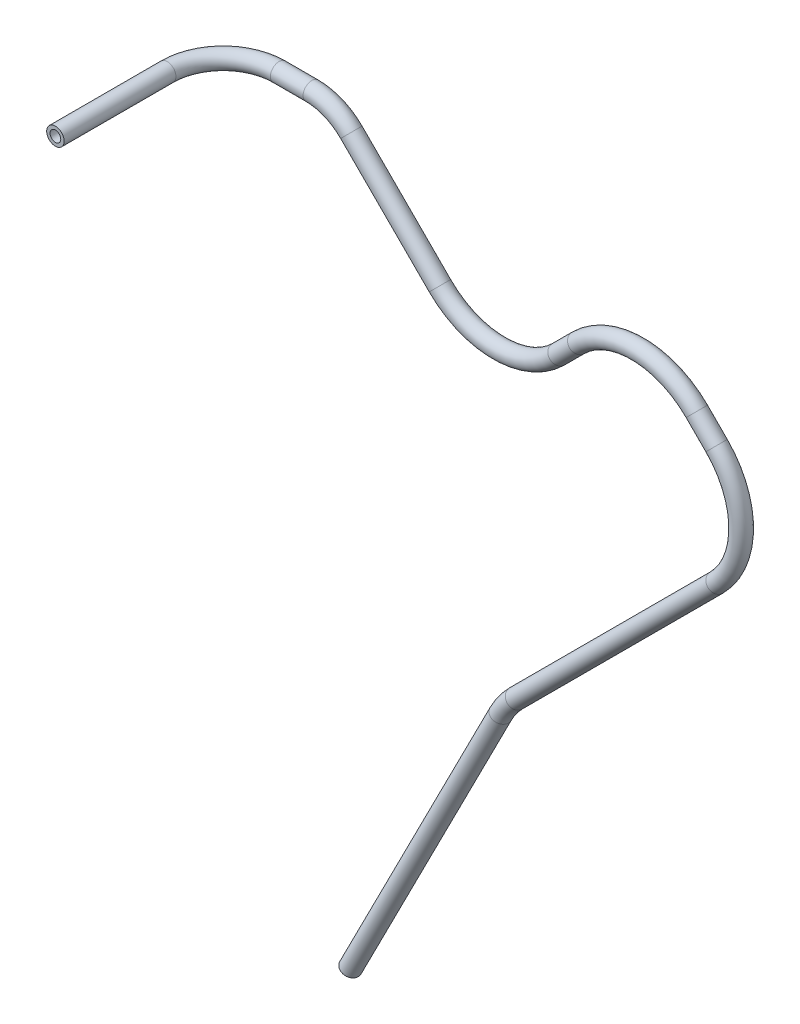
ISO-10303-21;
HEADER;
FILE_DESCRIPTION(('STEP AP214'),'2;1');
FILE_NAME('part.step','',(''),(''),'','','');
FILE_SCHEMA(('AUTOMOTIVE_DESIGN { 1 0 10303 214 1 1 1 1 }'));
ENDSEC;
DATA;
#1=APPLICATION_CONTEXT('core data for automotive mechanical design processes');
#2=APPLICATION_PROTOCOL_DEFINITION('international standard','automotive_design',2000,#1);
#3=PRODUCT_CONTEXT('',#1,'mechanical');
#4=PRODUCT('Part','Part','',(#3));
#5=PRODUCT_RELATED_PRODUCT_CATEGORY('part','',(#4));
#6=PRODUCT_DEFINITION_FORMATION('','',#4);
#7=PRODUCT_DEFINITION_CONTEXT('part definition',#1,'design');
#8=PRODUCT_DEFINITION('design','',#6,#7);
#9=PRODUCT_DEFINITION_SHAPE('','',#8);
#10=(LENGTH_UNIT() NAMED_UNIT(*) SI_UNIT(.MILLI.,.METRE.));
#11=(NAMED_UNIT(*) PLANE_ANGLE_UNIT() SI_UNIT($,.RADIAN.));
#12=(NAMED_UNIT(*) SI_UNIT($,.STERADIAN.) SOLID_ANGLE_UNIT());
#13=UNCERTAINTY_MEASURE_WITH_UNIT(LENGTH_MEASURE(1.E-05),#10,'distance_accuracy_value','');
#14=(GEOMETRIC_REPRESENTATION_CONTEXT(3) GLOBAL_UNCERTAINTY_ASSIGNED_CONTEXT((#13)) GLOBAL_UNIT_ASSIGNED_CONTEXT((#10,
#11,#12)) REPRESENTATION_CONTEXT('',''));
#15=CARTESIAN_POINT('',(0.,0.,0.));
#16=DIRECTION('',(0.,0.,1.));
#17=DIRECTION('',(1.,0.,0.));
#18=AXIS2_PLACEMENT_3D('',#15,#16,#17);
#19=CARTESIAN_POINT('',(0.,0.,0.));
#20=DIRECTION('',(0.,0.,-1.));
#21=DIRECTION('',(-1.,0.,0.));
#22=AXIS2_PLACEMENT_3D('',#19,#20,#21);
#23=CYLINDRICAL_SURFACE('',#22,7.9375);
#24=CARTESIAN_POINT('',(0.,0.,-101.6));
#25=DIRECTION('',(0.,0.,1.));
#26=DIRECTION('',(1.,0.,0.));
#27=AXIS2_PLACEMENT_3D('',#24,#25,#26);
#28=CIRCLE('',#27,7.9375);
#29=CARTESIAN_POINT('',(-7.9375,0.,-101.6));
#30=VERTEX_POINT('',#29);
#31=EDGE_CURVE('E171',#30,#30,#28,.T.);
#32=ORIENTED_EDGE('',*,*,#31,.T.);
#33=EDGE_LOOP('',(#32));
#34=FACE_BOUND('',#33,.T.);
#35=CARTESIAN_POINT('',(0.,0.,0.));
#36=DIRECTION('',(0.,0.,1.));
#37=DIRECTION('',(1.,0.,0.));
#38=AXIS2_PLACEMENT_3D('',#35,#36,#37);
#39=CIRCLE('',#38,7.9375);
#40=CARTESIAN_POINT('',(7.9375,0.,0.));
#41=VERTEX_POINT('',#40);
#42=EDGE_CURVE('E49',#41,#41,#39,.T.);
#43=ORIENTED_EDGE('',*,*,#42,.F.);
#44=EDGE_LOOP('',(#43));
#45=FACE_BOUND('',#44,.T.);
#46=ADVANCED_FACE('F34',(#34,#45),#23,.T.);
#47=CARTESIAN_POINT('',(50.8,0.,-101.6));
#48=DIRECTION('',(0.,-1.,0.));
#49=DIRECTION('',(0.,0.,-1.));
#50=AXIS2_PLACEMENT_3D('',#47,#48,#49);
#51=TOROIDAL_SURFACE('',#50,50.8,7.9375);
#52=CARTESIAN_POINT('',(50.8,0.,-152.4));
#53=DIRECTION('',(-1.,0.,0.));
#54=DIRECTION('',(0.,0.,1.));
#55=AXIS2_PLACEMENT_3D('',#52,#53,#54);
#56=CIRCLE('',#55,7.9375);
#57=CARTESIAN_POINT('',(50.8,0.,-160.3375));
#58=VERTEX_POINT('',#57);
#59=EDGE_CURVE('E174',#58,#58,#56,.T.);
#60=CARTESIAN_POINT('',(50.8,0.,-101.6));
#61=DIRECTION('',(0.,-1.,0.));
#62=DIRECTION('',(0.,0.,-1.));
#63=AXIS2_PLACEMENT_3D('',#60,#61,#62);
#64=CIRCLE('',#63,58.7375);
#65=EDGE_CURVE('',#30,#58,#64,.T.);
#66=ORIENTED_EDGE('',*,*,#31,.F.);
#67=ORIENTED_EDGE('',*,*,#59,.T.);
#68=ORIENTED_EDGE('',*,*,#65,.T.);
#69=ORIENTED_EDGE('',*,*,#65,.F.);
#70=EDGE_LOOP('',(#66,#68,#67,#69));
#71=FACE_BOUND('',#70,.T.);
#72=ADVANCED_FACE('F252',(#71),#51,.T.);
#73=CARTESIAN_POINT('',(50.8,0.,-152.4));
#74=DIRECTION('',(1.,0.,0.));
#75=DIRECTION('',(0.,0.,-1.));
#76=AXIS2_PLACEMENT_3D('',#73,#74,#75);
#77=CYLINDRICAL_SURFACE('',#76,7.9375);
#78=CARTESIAN_POINT('',(80.5579510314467,0.,-152.4));
#79=DIRECTION('',(-1.,0.,0.));
#80=DIRECTION('',(0.,0.,1.));
#81=AXIS2_PLACEMENT_3D('',#78,#79,#80);
#82=CIRCLE('',#81,7.9375);
#83=CARTESIAN_POINT('',(80.5579510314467,7.9375,-152.399999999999));
#84=VERTEX_POINT('',#83);
#85=EDGE_CURVE('E177',#84,#84,#82,.T.);
#86=ORIENTED_EDGE('',*,*,#85,.T.);
#87=EDGE_LOOP('',(#86));
#88=FACE_BOUND('',#87,.T.);
#89=ORIENTED_EDGE('',*,*,#59,.F.);
#90=EDGE_LOOP('',(#89));
#91=FACE_BOUND('',#90,.T.);
#92=ADVANCED_FACE('F248',(#88,#91),#77,.T.);
#93=CARTESIAN_POINT('',(80.5579510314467,-50.8,-152.400000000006));
#94=DIRECTION('',(0.,0.,-1.));
#95=DIRECTION('',(0.,1.,0.));
#96=AXIS2_PLACEMENT_3D('',#93,#94,#95);
#97=TOROIDAL_SURFACE('',#96,50.8,7.9375);
#98=CARTESIAN_POINT('',(116.478975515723,-14.8789755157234,-152.400000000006));
#99=DIRECTION('',(-0.707106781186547,0.707106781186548,0.));
#100=DIRECTION('',(0.,0.,1.));
#101=AXIS2_PLACEMENT_3D('',#98,#99,#100);
#102=CIRCLE('',#101,7.9375);
#103=CARTESIAN_POINT('',(122.091635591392,-9.26631544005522,-152.400000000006));
#104=VERTEX_POINT('',#103);
#105=EDGE_CURVE('E180',#104,#104,#102,.T.);
#106=CARTESIAN_POINT('',(80.5579510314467,-50.8,-152.400000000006));
#107=DIRECTION('',(0.,0.,-1.));
#108=DIRECTION('',(0.,1.,0.));
#109=AXIS2_PLACEMENT_3D('',#106,#107,#108);
#110=CIRCLE('',#109,58.7375);
#111=EDGE_CURVE('',#84,#104,#110,.T.);
#112=ORIENTED_EDGE('',*,*,#85,.F.);
#113=ORIENTED_EDGE('',*,*,#105,.T.);
#114=ORIENTED_EDGE('',*,*,#111,.T.);
#115=ORIENTED_EDGE('',*,*,#111,.F.);
#116=EDGE_LOOP('',(#112,#114,#113,#115));
#117=FACE_BOUND('',#116,.T.);
#118=ADVANCED_FACE('F244',(#117),#97,.T.);
#119=CARTESIAN_POINT('',(116.478975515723,-14.8789755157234,-152.400000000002));
#120=DIRECTION('',(0.707106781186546,-0.707106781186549,0.));
#121=DIRECTION('',(0.707106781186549,0.707106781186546,0.));
#122=AXIS2_PLACEMENT_3D('',#119,#120,#121);
#123=CYLINDRICAL_SURFACE('',#122,7.9375);
#124=CARTESIAN_POINT('',(196.965593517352,-95.3655935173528,-152.399999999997));
#125=DIRECTION('',(-0.707106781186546,0.707106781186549,0.));
#126=DIRECTION('',(0.,0.,1.));
#127=AXIS2_PLACEMENT_3D('',#124,#125,#126);
#128=CIRCLE('',#127,7.9375);
#129=CARTESIAN_POINT('',(191.352933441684,-100.978253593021,-152.399999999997));
#130=VERTEX_POINT('',#129);
#131=EDGE_CURVE('E183',#130,#130,#128,.T.);
#132=ORIENTED_EDGE('',*,*,#131,.T.);
#133=EDGE_LOOP('',(#132));
#134=FACE_BOUND('',#133,.T.);
#135=ORIENTED_EDGE('',*,*,#105,.F.);
#136=EDGE_LOOP('',(#135));
#137=FACE_BOUND('',#136,.T.);
#138=ADVANCED_FACE('F240',(#134,#137),#123,.T.);
#139=CARTESIAN_POINT('',(250.847130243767,-41.4840567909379,-152.399999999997));
#140=DIRECTION('',(0.,0.,1.));
#141=DIRECTION('',(1.,0.,0.));
#142=AXIS2_PLACEMENT_3D('',#139,#140,#141);
#143=TOROIDAL_SURFACE('',#142,76.2,7.9375);
#144=CARTESIAN_POINT('',(304.728666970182,-95.3655935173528,-152.399999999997));
#145=DIRECTION('',(-0.707106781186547,-0.707106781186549,0.));
#146=DIRECTION('',(0.,0.,1.));
#147=AXIS2_PLACEMENT_3D('',#144,#145,#146);
#148=CIRCLE('',#147,7.9375);
#149=CARTESIAN_POINT('',(310.341327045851,-100.978253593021,-152.399999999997));
#150=VERTEX_POINT('',#149);
#151=EDGE_CURVE('E186',#150,#150,#148,.T.);
#152=CARTESIAN_POINT('',(250.847130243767,-41.4840567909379,-152.399999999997));
#153=DIRECTION('',(0.,0.,1.));
#154=DIRECTION('',(1.,0.,0.));
#155=AXIS2_PLACEMENT_3D('',#152,#153,#154);
#156=CIRCLE('',#155,84.1375);
#157=EDGE_CURVE('',#130,#150,#156,.T.);
#158=ORIENTED_EDGE('',*,*,#131,.F.);
#159=ORIENTED_EDGE('',*,*,#151,.T.);
#160=ORIENTED_EDGE('',*,*,#157,.T.);
#161=ORIENTED_EDGE('',*,*,#157,.F.);
#162=EDGE_LOOP('',(#158,#160,#159,#161));
#163=FACE_BOUND('',#162,.T.);
#164=ADVANCED_FACE('F236',(#163),#143,.T.);
#165=CARTESIAN_POINT('',(304.728666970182,-95.3655935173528,-152.399999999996));
#166=DIRECTION('',(0.707106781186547,0.707106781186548,0.));
#167=DIRECTION('',(-0.707106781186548,0.707106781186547,0.));
#168=AXIS2_PLACEMENT_3D('',#165,#166,#167);
#169=CYLINDRICAL_SURFACE('',#168,7.9375);
#170=CARTESIAN_POINT('',(322.574619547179,-77.5196409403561,-152.399999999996));
#171=DIRECTION('',(-0.707106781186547,-0.707106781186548,0.));
#172=DIRECTION('',(0.,0.,1.));
#173=AXIS2_PLACEMENT_3D('',#170,#171,#172);
#174=CIRCLE('',#173,7.9375);
#175=CARTESIAN_POINT('',(316.961959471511,-71.9069808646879,-152.399999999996));
#176=VERTEX_POINT('',#175);
#177=EDGE_CURVE('E189',#176,#176,#174,.T.);
#178=ORIENTED_EDGE('',*,*,#177,.T.);
#179=EDGE_LOOP('',(#178));
#180=FACE_BOUND('',#179,.T.);
#181=ORIENTED_EDGE('',*,*,#151,.F.);
#182=EDGE_LOOP('',(#181));
#183=FACE_BOUND('',#182,.T.);
#184=ADVANCED_FACE('F232',(#180,#183),#169,.T.);
#185=CARTESIAN_POINT('',(376.456156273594,-131.401177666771,-152.399999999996));
#186=DIRECTION('',(0.,0.,-1.));
#187=DIRECTION('',(-1.,0.,0.));
#188=AXIS2_PLACEMENT_3D('',#185,#186,#187);
#189=TOROIDAL_SURFACE('',#188,76.2,7.9375);
#190=CARTESIAN_POINT('',(430.337693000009,-77.519640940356,-152.399999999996));
#191=DIRECTION('',(-0.707106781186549,0.707106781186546,0.));
#192=DIRECTION('',(0.,0.,1.));
#193=AXIS2_PLACEMENT_3D('',#190,#191,#192);
#194=CIRCLE('',#193,7.9375);
#195=CARTESIAN_POINT('',(435.950353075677,-71.9069808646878,-152.399999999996));
#196=VERTEX_POINT('',#195);
#197=EDGE_CURVE('E192',#196,#196,#194,.T.);
#198=CARTESIAN_POINT('',(376.456156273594,-131.401177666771,-152.399999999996));
#199=DIRECTION('',(0.,0.,-1.));
#200=DIRECTION('',(-1.,0.,0.));
#201=AXIS2_PLACEMENT_3D('',#198,#199,#200);
#202=CIRCLE('',#201,84.1375);
#203=EDGE_CURVE('',#176,#196,#202,.T.);
#204=ORIENTED_EDGE('',*,*,#177,.F.);
#205=ORIENTED_EDGE('',*,*,#197,.T.);
#206=ORIENTED_EDGE('',*,*,#203,.T.);
#207=ORIENTED_EDGE('',*,*,#203,.F.);
#208=EDGE_LOOP('',(#204,#206,#205,#207));
#209=FACE_BOUND('',#208,.T.);
#210=ADVANCED_FACE('F228',(#209),#189,.T.);
#211=CARTESIAN_POINT('',(430.337693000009,-77.519640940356,-152.399999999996));
#212=DIRECTION('',(0.707106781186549,-0.707106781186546,0.));
#213=DIRECTION('',(0.707106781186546,0.707106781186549,0.));
#214=AXIS2_PLACEMENT_3D('',#211,#212,#213);
#215=CYLINDRICAL_SURFACE('',#214,7.9375);
#216=CARTESIAN_POINT('',(448.298205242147,-95.4801531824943,-152.399999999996));
#217=DIRECTION('',(-0.707106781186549,0.707106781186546,0.));
#218=DIRECTION('',(0.,0.,1.));
#219=AXIS2_PLACEMENT_3D('',#216,#217,#218);
#220=CIRCLE('',#219,7.9375);
#221=CARTESIAN_POINT('',(453.910865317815,-89.8674931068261,-152.399999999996));
#222=VERTEX_POINT('',#221);
#223=EDGE_CURVE('E195',#222,#222,#220,.T.);
#224=CARTESIAN_POINT('',(453.910865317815,-89.8674931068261,-152.399999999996));
#225=CARTESIAN_POINT('',(453.723776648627,-89.6804044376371,-152.399999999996));
#226=CARTESIAN_POINT('',(453.536687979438,-89.4933157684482,-152.399999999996));
#227=CARTESIAN_POINT('',(453.16251064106,-89.1191384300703,-152.399999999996));
#228=CARTESIAN_POINT('',(452.975421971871,-88.9320497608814,-152.399999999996));
#229=CARTESIAN_POINT('',(452.601244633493,-88.5578724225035,-152.399999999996));
#230=CARTESIAN_POINT('',(452.414155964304,-88.3707837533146,-152.399999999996));
#231=CARTESIAN_POINT('',(452.039978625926,-87.9966064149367,-152.399999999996));
#232=CARTESIAN_POINT('',(451.852889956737,-87.8095177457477,-152.399999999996));
#233=CARTESIAN_POINT('',(451.478712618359,-87.4353404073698,-152.399999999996));
#234=CARTESIAN_POINT('',(451.29162394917,-87.2482517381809,-152.399999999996));
#235=CARTESIAN_POINT('',(450.917446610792,-86.874074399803,-152.399999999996));
#236=CARTESIAN_POINT('',(450.730357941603,-86.6869857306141,-152.399999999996));
#237=CARTESIAN_POINT('',(450.356180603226,-86.3128083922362,-152.399999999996));
#238=CARTESIAN_POINT('',(450.169091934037,-86.1257197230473,-152.399999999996));
#239=CARTESIAN_POINT('',(449.794914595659,-85.7515423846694,-152.399999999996));
#240=CARTESIAN_POINT('',(449.60782592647,-85.5644537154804,-152.399999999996));
#241=CARTESIAN_POINT('',(449.233648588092,-85.1902763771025,-152.399999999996));
#242=CARTESIAN_POINT('',(449.046559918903,-85.0031877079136,-152.399999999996));
#243=CARTESIAN_POINT('',(448.672382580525,-84.6290103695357,-152.399999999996));
#244=CARTESIAN_POINT('',(448.485293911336,-84.4419217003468,-152.399999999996));
#245=CARTESIAN_POINT('',(448.111116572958,-84.0677443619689,-152.399999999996));
#246=CARTESIAN_POINT('',(447.924027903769,-83.88065569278,-152.399999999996));
#247=CARTESIAN_POINT('',(447.549850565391,-83.5064783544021,-152.399999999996));
#248=CARTESIAN_POINT('',(447.362761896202,-83.3193896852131,-152.399999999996));
#249=CARTESIAN_POINT('',(446.988584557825,-82.9452123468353,-152.399999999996));
#250=CARTESIAN_POINT('',(446.801495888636,-82.7581236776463,-152.399999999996));
#251=CARTESIAN_POINT('',(446.427318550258,-82.3839463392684,-152.399999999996));
#252=CARTESIAN_POINT('',(446.240229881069,-82.1968576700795,-152.399999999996));
#253=CARTESIAN_POINT('',(445.866052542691,-81.8226803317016,-152.399999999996));
#254=CARTESIAN_POINT('',(445.678963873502,-81.6355916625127,-152.399999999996));
#255=CARTESIAN_POINT('',(445.304786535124,-81.2614143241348,-152.399999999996));
#256=CARTESIAN_POINT('',(445.117697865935,-81.0743256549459,-152.399999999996));
#257=CARTESIAN_POINT('',(444.743520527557,-80.700148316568,-152.399999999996));
#258=CARTESIAN_POINT('',(444.556431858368,-80.513059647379,-152.399999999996));
#259=CARTESIAN_POINT('',(444.18225451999,-80.1388823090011,-152.399999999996));
#260=CARTESIAN_POINT('',(443.995165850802,-79.9517936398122,-152.399999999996));
#261=CARTESIAN_POINT('',(443.620988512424,-79.5776163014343,-152.399999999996));
#262=CARTESIAN_POINT('',(443.433899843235,-79.3905276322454,-152.399999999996));
#263=CARTESIAN_POINT('',(443.059722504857,-79.0163502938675,-152.399999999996));
#264=CARTESIAN_POINT('',(442.872633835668,-78.8292616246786,-152.399999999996));
#265=CARTESIAN_POINT('',(442.49845649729,-78.4550842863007,-152.399999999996));
#266=CARTESIAN_POINT('',(442.311367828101,-78.2679956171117,-152.399999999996));
#267=CARTESIAN_POINT('',(441.937190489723,-77.8938182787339,-152.399999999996));
#268=CARTESIAN_POINT('',(441.750101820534,-77.7067296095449,-152.399999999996));
#269=CARTESIAN_POINT('',(441.375924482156,-77.332552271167,-152.399999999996));
#270=CARTESIAN_POINT('',(441.188835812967,-77.1454636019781,-152.399999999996));
#271=CARTESIAN_POINT('',(440.81465847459,-76.7712862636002,-152.399999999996));
#272=CARTESIAN_POINT('',(440.627569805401,-76.5841975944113,-152.399999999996));
#273=CARTESIAN_POINT('',(440.253392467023,-76.2100202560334,-152.399999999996));
#274=CARTESIAN_POINT('',(440.066303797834,-76.0229315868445,-152.399999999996));
#275=CARTESIAN_POINT('',(439.692126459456,-75.6487542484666,-152.399999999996));
#276=CARTESIAN_POINT('',(439.505037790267,-75.4616655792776,-152.399999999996));
#277=CARTESIAN_POINT('',(439.130860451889,-75.0874882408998,-152.399999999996));
#278=CARTESIAN_POINT('',(438.9437717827,-74.9003995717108,-152.399999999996));
#279=CARTESIAN_POINT('',(438.569594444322,-74.5262222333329,-152.399999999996));
#280=CARTESIAN_POINT('',(438.382505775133,-74.339133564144,-152.399999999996));
#281=CARTESIAN_POINT('',(438.008328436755,-73.9649562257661,-152.399999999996));
#282=CARTESIAN_POINT('',(437.821239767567,-73.7778675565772,-152.399999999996));
#283=CARTESIAN_POINT('',(437.447062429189,-73.4036902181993,-152.399999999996));
#284=CARTESIAN_POINT('',(437.25997376,-73.2166015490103,-152.399999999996));
#285=CARTESIAN_POINT('',(436.885796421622,-72.8424242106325,-152.399999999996));
#286=CARTESIAN_POINT('',(436.698707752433,-72.6553355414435,-152.399999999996));
#287=CARTESIAN_POINT('',(436.324530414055,-72.2811582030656,-152.399999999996));
#288=CARTESIAN_POINT('',(436.137441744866,-72.0940695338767,-152.399999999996));
#289=CARTESIAN_POINT('',(435.950353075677,-71.9069808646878,-152.399999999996));
#290=B_SPLINE_CURVE_WITH_KNOTS('',3,(#224,#225,#226,#227,#228,#229,#230,#231,#232,#233,#234,
#235,#236,#237,#238,#239,#240,#241,#242,#243,#244,#245,#246,#247,#248,#249,#250,#251,#252,#253,
#254,#255,#256,#257,#258,#259,#260,#261,#262,#263,#264,#265,#266,#267,#268,#269,#270,#271,#272,
#273,#274,#275,#276,#277,#278,#279,#280,#281,#282,#283,#284,#285,#286,#287,#288,#289),
.UNSPECIFIED.,.F.,.F.,(4,2,2,2,2,2,2,2,2,2,2,2,2,2,2,2,2,2,2,2,2,2,2,2,2,2,2,2,2,2,2,2,4),(0.,
0.793750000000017,1.58750000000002,2.38125000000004,3.17500000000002,3.96875000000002,
4.76250000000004,5.55625000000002,6.35000000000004,7.14375000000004,7.93750000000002,
8.73125000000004,9.52500000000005,10.3187500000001,11.1125,11.9062500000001,12.7000000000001,
13.4937500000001,14.2875000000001,15.0812500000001,15.8750000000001,16.6687500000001,
17.4625000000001,18.2562500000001,19.0500000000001,19.8437500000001,20.6375000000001,
21.4312500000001,22.2250000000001,23.0187500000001,23.8125000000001,24.6062500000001,
25.4000000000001),.UNSPECIFIED.);
#291=EDGE_CURVE('BSEAM224',#222,#196,#290,.T.);
#292=ORIENTED_EDGE('',*,*,#223,.T.);
#293=ORIENTED_EDGE('',*,*,#197,.F.);
#294=ORIENTED_EDGE('',*,*,#291,.T.);
#295=ORIENTED_EDGE('',*,*,#291,.F.);
#296=EDGE_LOOP('',(#292,#294,#293,#295));
#297=FACE_BOUND('',#296,.T.);
#298=ADVANCED_FACE('F224',(#297),#215,.T.);
#299=CARTESIAN_POINT('',(394.416668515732,-149.361689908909,-152.399999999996));
#300=DIRECTION('',(0.,0.,-1.));
#301=DIRECTION('',(-1.,0.,0.));
#302=AXIS2_PLACEMENT_3D('',#299,#300,#301);
#303=TOROIDAL_SURFACE('',#302,76.2,7.9375);
#304=CARTESIAN_POINT('',(448.298205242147,-203.243226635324,-152.399999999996));
#305=DIRECTION('',(0.707106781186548,0.707106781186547,0.));
#306=DIRECTION('',(0.,0.,1.));
#307=AXIS2_PLACEMENT_3D('',#304,#305,#306);
#308=CIRCLE('',#307,7.9375);
#309=CARTESIAN_POINT('',(453.910865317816,-208.855886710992,-152.399999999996));
#310=VERTEX_POINT('',#309);
#311=EDGE_CURVE('E198',#310,#310,#308,.T.);
#312=CARTESIAN_POINT('',(394.416668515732,-149.361689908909,-152.399999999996));
#313=DIRECTION('',(0.,0.,-1.));
#314=DIRECTION('',(-1.,0.,0.));
#315=AXIS2_PLACEMENT_3D('',#312,#313,#314);
#316=CIRCLE('',#315,84.1375);
#317=EDGE_CURVE('',#222,#310,#316,.T.);
#318=ORIENTED_EDGE('',*,*,#223,.F.);
#319=ORIENTED_EDGE('',*,*,#311,.T.);
#320=ORIENTED_EDGE('',*,*,#317,.T.);
#321=ORIENTED_EDGE('',*,*,#317,.F.);
#322=EDGE_LOOP('',(#318,#320,#319,#321));
#323=FACE_BOUND('',#322,.T.);
#324=ADVANCED_FACE('F219',(#323),#303,.T.);
#325=CARTESIAN_POINT('',(448.298205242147,-203.243226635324,-152.399999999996));
#326=DIRECTION('',(-0.707106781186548,-0.707106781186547,0.));
#327=DIRECTION('',(0.707106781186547,-0.707106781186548,0.));
#328=AXIS2_PLACEMENT_3D('',#325,#326,#327);
#329=CYLINDRICAL_SURFACE('',#328,7.9375);
#330=CARTESIAN_POINT('',(266.096877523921,-385.44455435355,-152.399999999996));
#331=DIRECTION('',(0.707106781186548,0.707106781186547,0.));
#332=DIRECTION('',(0.,0.,1.));
#333=AXIS2_PLACEMENT_3D('',#330,#331,#332);
#334=CIRCLE('',#333,7.9375);
#335=CARTESIAN_POINT('',(260.484217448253,-379.831894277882,-152.399999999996));
#336=VERTEX_POINT('',#335);
#337=EDGE_CURVE('E200',#336,#336,#334,.T.);
#338=ORIENTED_EDGE('',*,*,#337,.T.);
#339=EDGE_LOOP('',(#338));
#340=FACE_BOUND('',#339,.T.);
#341=ORIENTED_EDGE('',*,*,#311,.F.);
#342=EDGE_LOOP('',(#341));
#343=FACE_BOUND('',#342,.T.);
#344=ADVANCED_FACE('F215',(#340,#343),#329,.T.);
#345=CARTESIAN_POINT('',(319.978414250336,-439.326091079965,-152.399999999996));
#346=DIRECTION('',(0.,0.,1.));
#347=DIRECTION('',(1.,0.,0.));
#348=AXIS2_PLACEMENT_3D('',#345,#346,#347);
#349=TOROIDAL_SURFACE('',#348,76.2,7.9375);
#350=CARTESIAN_POINT('',(252.080309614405,-404.738703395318,-152.399999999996));
#351=DIRECTION('',(0.453902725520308,0.891051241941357,0.));
#352=DIRECTION('',(0.,0.,1.));
#353=AXIS2_PLACEMENT_3D('',#350,#351,#352);
#354=CIRCLE('',#353,7.9375);
#355=CARTESIAN_POINT('',(245.007590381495,-401.1358505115,-152.399999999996));
#356=VERTEX_POINT('',#355);
#357=EDGE_CURVE('E38',#356,#356,#354,.T.);
#358=CARTESIAN_POINT('',(319.978414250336,-439.326091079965,-152.399999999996));
#359=DIRECTION('',(0.,0.,1.));
#360=DIRECTION('',(1.,0.,0.));
#361=AXIS2_PLACEMENT_3D('',#358,#359,#360);
#362=CIRCLE('',#361,84.1375);
#363=EDGE_CURVE('',#336,#356,#362,.T.);
#364=ORIENTED_EDGE('',*,*,#337,.F.);
#365=ORIENTED_EDGE('',*,*,#357,.T.);
#366=ORIENTED_EDGE('',*,*,#363,.T.);
#367=ORIENTED_EDGE('',*,*,#363,.F.);
#368=EDGE_LOOP('',(#364,#366,#365,#367));
#369=FACE_BOUND('',#368,.T.);
#370=ADVANCED_FACE('F207',(#369),#349,.T.);
#371=CARTESIAN_POINT('',(252.080309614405,-404.738703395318,-152.399999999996));
#372=DIRECTION('',(-0.453902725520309,-0.891051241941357,0.));
#373=DIRECTION('',(0.891051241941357,-0.453902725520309,0.));
#374=AXIS2_PLACEMENT_3D('',#371,#372,#373);
#375=CYLINDRICAL_SURFACE('',#374,7.9375);
#376=CARTESIAN_POINT('',(115.666291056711,-672.531500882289,-152.399999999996));
#377=DIRECTION('',(0.453902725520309,0.891051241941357,0.));
#378=DIRECTION('',(0.,0.,1.));
#379=AXIS2_PLACEMENT_3D('',#376,#377,#378);
#380=CIRCLE('',#379,7.9375);
#381=CARTESIAN_POINT('',(115.666291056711,-672.531500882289,-144.462499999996));
#382=VERTEX_POINT('',#381);
#383=EDGE_CURVE('E54',#382,#382,#380,.T.);
#384=ORIENTED_EDGE('',*,*,#383,.T.);
#385=EDGE_LOOP('',(#384));
#386=FACE_BOUND('',#385,.T.);
#387=ORIENTED_EDGE('',*,*,#357,.F.);
#388=EDGE_LOOP('',(#387));
#389=FACE_BOUND('',#388,.T.);
#390=ADVANCED_FACE('F36',(#386,#389),#375,.T.);
#391=CARTESIAN_POINT('',(0.,0.,0.));
#392=DIRECTION('',(0.,0.,1.));
#393=DIRECTION('',(1.,0.,0.));
#394=AXIS2_PLACEMENT_3D('',#391,#392,#393);
#395=PLANE('',#394);
#396=CARTESIAN_POINT('',(0.,0.,0.));
#397=DIRECTION('',(0.,0.,1.));
#398=DIRECTION('',(1.,0.,0.));
#399=AXIS2_PLACEMENT_3D('',#396,#397,#398);
#400=CIRCLE('',#399,4.8641);
#401=CARTESIAN_POINT('',(4.8641,0.,0.));
#402=VERTEX_POINT('',#401);
#403=EDGE_CURVE('E134',#402,#402,#400,.F.);
#404=ORIENTED_EDGE('',*,*,#403,.T.);
#405=EDGE_LOOP('',(#404));
#406=FACE_BOUND('',#405,.T.);
#407=ORIENTED_EDGE('',*,*,#42,.T.);
#408=EDGE_LOOP('',(#407));
#409=FACE_BOUND('',#408,.T.);
#410=ADVANCED_FACE('F67',(#406,#409),#395,.T.);
#411=CARTESIAN_POINT('',(115.666291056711,-672.531500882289,-152.399999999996));
#412=DIRECTION('',(0.453902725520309,0.891051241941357,0.));
#413=DIRECTION('',(0.,0.,1.));
#414=AXIS2_PLACEMENT_3D('',#411,#412,#413);
#415=PLANE('',#414);
#416=CARTESIAN_POINT('',(115.666291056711,-672.531500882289,-152.399999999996));
#417=DIRECTION('',(0.453902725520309,0.891051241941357,0.));
#418=DIRECTION('',(0.,0.,1.));
#419=AXIS2_PLACEMENT_3D('',#416,#417,#418);
#420=CIRCLE('',#419,4.8641);
#421=CARTESIAN_POINT('',(115.666291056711,-672.531500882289,-147.535899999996));
#422=VERTEX_POINT('',#421);
#423=EDGE_CURVE('E11',#422,#422,#420,.F.);
#424=ORIENTED_EDGE('',*,*,#423,.F.);
#425=EDGE_LOOP('',(#424));
#426=FACE_BOUND('',#425,.T.);
#427=ORIENTED_EDGE('',*,*,#383,.F.);
#428=EDGE_LOOP('',(#427));
#429=FACE_BOUND('',#428,.T.);
#430=ADVANCED_FACE('F64',(#426,#429),#415,.F.);
#431=CARTESIAN_POINT('',(0.,0.,0.));
#432=DIRECTION('',(0.,0.,-1.));
#433=DIRECTION('',(-1.,0.,0.));
#434=AXIS2_PLACEMENT_3D('',#431,#432,#433);
#435=CYLINDRICAL_SURFACE('',#434,4.8641);
#436=CARTESIAN_POINT('',(0.,0.,-101.6));
#437=DIRECTION('',(0.,0.,1.));
#438=DIRECTION('',(1.,0.,0.));
#439=AXIS2_PLACEMENT_3D('',#436,#437,#438);
#440=CIRCLE('',#439,4.8641);
#441=CARTESIAN_POINT('',(-4.8641,0.,-101.6));
#442=VERTEX_POINT('',#441);
#443=EDGE_CURVE('E133',#442,#442,#440,.F.);
#444=ORIENTED_EDGE('',*,*,#443,.T.);
#445=EDGE_LOOP('',(#444));
#446=FACE_BOUND('',#445,.T.);
#447=ORIENTED_EDGE('',*,*,#403,.F.);
#448=EDGE_LOOP('',(#447));
#449=FACE_BOUND('',#448,.T.);
#450=ADVANCED_FACE('F66',(#446,#449),#435,.F.);
#451=CARTESIAN_POINT('',(50.8,0.,-101.6));
#452=DIRECTION('',(0.,-1.,0.));
#453=DIRECTION('',(0.,0.,-1.));
#454=AXIS2_PLACEMENT_3D('',#451,#452,#453);
#455=TOROIDAL_SURFACE('',#454,50.8,4.8641);
#456=CARTESIAN_POINT('',(50.8,0.,-152.4));
#457=DIRECTION('',(-1.,0.,0.));
#458=DIRECTION('',(0.,0.,1.));
#459=AXIS2_PLACEMENT_3D('',#456,#457,#458);
#460=CIRCLE('',#459,4.8641);
#461=CARTESIAN_POINT('',(50.8,0.,-157.2641));
#462=VERTEX_POINT('',#461);
#463=EDGE_CURVE('E130',#462,#462,#460,.F.);
#464=CARTESIAN_POINT('',(50.8,0.,-101.6));
#465=DIRECTION('',(0.,-1.,0.));
#466=DIRECTION('',(0.,0.,-1.));
#467=AXIS2_PLACEMENT_3D('',#464,#465,#466);
#468=CIRCLE('',#467,55.6641);
#469=EDGE_CURVE('',#442,#462,#468,.T.);
#470=ORIENTED_EDGE('',*,*,#443,.F.);
#471=ORIENTED_EDGE('',*,*,#463,.T.);
#472=ORIENTED_EDGE('',*,*,#469,.T.);
#473=ORIENTED_EDGE('',*,*,#469,.F.);
#474=EDGE_LOOP('',(#470,#472,#471,#473));
#475=FACE_BOUND('',#474,.T.);
#476=ADVANCED_FACE('F73',(#475),#455,.F.);
#477=CARTESIAN_POINT('',(50.8,0.,-152.4));
#478=DIRECTION('',(1.,0.,0.));
#479=DIRECTION('',(0.,0.,-1.));
#480=AXIS2_PLACEMENT_3D('',#477,#478,#479);
#481=CYLINDRICAL_SURFACE('',#480,4.8641);
#482=CARTESIAN_POINT('',(80.5579510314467,0.,-152.4));
#483=DIRECTION('',(-1.,0.,0.));
#484=DIRECTION('',(0.,0.,1.));
#485=AXIS2_PLACEMENT_3D('',#482,#483,#484);
#486=CIRCLE('',#485,4.8641);
#487=CARTESIAN_POINT('',(80.5579510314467,4.8641,-152.399999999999));
#488=VERTEX_POINT('',#487);
#489=EDGE_CURVE('E136',#488,#488,#486,.F.);
#490=ORIENTED_EDGE('',*,*,#489,.T.);
#491=EDGE_LOOP('',(#490));
#492=FACE_BOUND('',#491,.T.);
#493=ORIENTED_EDGE('',*,*,#463,.F.);
#494=EDGE_LOOP('',(#493));
#495=FACE_BOUND('',#494,.T.);
#496=ADVANCED_FACE('F118',(#492,#495),#481,.F.);
#497=CARTESIAN_POINT('',(80.5579510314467,-50.8,-152.400000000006));
#498=DIRECTION('',(0.,0.,-1.));
#499=DIRECTION('',(0.,1.,0.));
#500=AXIS2_PLACEMENT_3D('',#497,#498,#499);
#501=TOROIDAL_SURFACE('',#500,50.8,4.8641);
#502=CARTESIAN_POINT('',(116.478975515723,-14.8789755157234,-152.400000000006));
#503=DIRECTION('',(-0.707106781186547,0.707106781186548,0.));
#504=DIRECTION('',(0.,0.,1.));
#505=AXIS2_PLACEMENT_3D('',#502,#503,#504);
#506=CIRCLE('',#505,4.8641);
#507=CARTESIAN_POINT('',(119.918413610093,-11.439537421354,-152.400000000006));
#508=VERTEX_POINT('',#507);
#509=EDGE_CURVE('E143',#508,#508,#506,.F.);
#510=CARTESIAN_POINT('',(80.5579510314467,-50.8,-152.400000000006));
#511=DIRECTION('',(0.,0.,-1.));
#512=DIRECTION('',(0.,1.,0.));
#513=AXIS2_PLACEMENT_3D('',#510,#511,#512);
#514=CIRCLE('',#513,55.6641);
#515=EDGE_CURVE('',#488,#508,#514,.T.);
#516=ORIENTED_EDGE('',*,*,#489,.F.);
#517=ORIENTED_EDGE('',*,*,#509,.T.);
#518=ORIENTED_EDGE('',*,*,#515,.T.);
#519=ORIENTED_EDGE('',*,*,#515,.F.);
#520=EDGE_LOOP('',(#516,#518,#517,#519));
#521=FACE_BOUND('',#520,.T.);
#522=ADVANCED_FACE('F114',(#521),#501,.F.);
#523=CARTESIAN_POINT('',(116.478975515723,-14.8789755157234,-152.400000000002));
#524=DIRECTION('',(0.707106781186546,-0.707106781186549,0.));
#525=DIRECTION('',(0.707106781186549,0.707106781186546,0.));
#526=AXIS2_PLACEMENT_3D('',#523,#524,#525);
#527=CYLINDRICAL_SURFACE('',#526,4.8641);
#528=CARTESIAN_POINT('',(196.965593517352,-95.3655935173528,-152.399999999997));
#529=DIRECTION('',(-0.707106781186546,0.707106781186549,0.));
#530=DIRECTION('',(0.,0.,1.));
#531=AXIS2_PLACEMENT_3D('',#528,#529,#530);
#532=CIRCLE('',#531,4.8641);
#533=CARTESIAN_POINT('',(193.526155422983,-98.8050316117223,-152.399999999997));
#534=VERTEX_POINT('',#533);
#535=EDGE_CURVE('E146',#534,#534,#532,.F.);
#536=ORIENTED_EDGE('',*,*,#535,.T.);
#537=EDGE_LOOP('',(#536));
#538=FACE_BOUND('',#537,.T.);
#539=ORIENTED_EDGE('',*,*,#509,.F.);
#540=EDGE_LOOP('',(#539));
#541=FACE_BOUND('',#540,.T.);
#542=ADVANCED_FACE('F110',(#538,#541),#527,.F.);
#543=CARTESIAN_POINT('',(250.847130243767,-41.4840567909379,-152.399999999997));
#544=DIRECTION('',(0.,0.,1.));
#545=DIRECTION('',(1.,0.,0.));
#546=AXIS2_PLACEMENT_3D('',#543,#544,#545);
#547=TOROIDAL_SURFACE('',#546,76.2,4.8641);
#548=CARTESIAN_POINT('',(304.728666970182,-95.3655935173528,-152.399999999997));
#549=DIRECTION('',(-0.707106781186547,-0.707106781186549,0.));
#550=DIRECTION('',(0.,0.,1.));
#551=AXIS2_PLACEMENT_3D('',#548,#549,#550);
#552=CIRCLE('',#551,4.8641);
#553=CARTESIAN_POINT('',(308.168105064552,-98.8050316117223,-152.399999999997));
#554=VERTEX_POINT('',#553);
#555=EDGE_CURVE('E149',#554,#554,#552,.F.);
#556=CARTESIAN_POINT('',(250.847130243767,-41.4840567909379,-152.399999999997));
#557=DIRECTION('',(0.,0.,1.));
#558=DIRECTION('',(1.,0.,0.));
#559=AXIS2_PLACEMENT_3D('',#556,#557,#558);
#560=CIRCLE('',#559,81.0641);
#561=EDGE_CURVE('',#534,#554,#560,.T.);
#562=ORIENTED_EDGE('',*,*,#535,.F.);
#563=ORIENTED_EDGE('',*,*,#555,.T.);
#564=ORIENTED_EDGE('',*,*,#561,.T.);
#565=ORIENTED_EDGE('',*,*,#561,.F.);
#566=EDGE_LOOP('',(#562,#564,#563,#565));
#567=FACE_BOUND('',#566,.T.);
#568=ADVANCED_FACE('F106',(#567),#547,.F.);
#569=CARTESIAN_POINT('',(304.728666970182,-95.3655935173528,-152.399999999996));
#570=DIRECTION('',(0.707106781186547,0.707106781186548,0.));
#571=DIRECTION('',(-0.707106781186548,0.707106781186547,0.));
#572=AXIS2_PLACEMENT_3D('',#569,#570,#571);
#573=CYLINDRICAL_SURFACE('',#572,4.8641);
#574=CARTESIAN_POINT('',(322.574619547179,-77.5196409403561,-152.399999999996));
#575=DIRECTION('',(-0.707106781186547,-0.707106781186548,0.));
#576=DIRECTION('',(0.,0.,1.));
#577=AXIS2_PLACEMENT_3D('',#574,#575,#576);
#578=CIRCLE('',#577,4.8641);
#579=CARTESIAN_POINT('',(319.13518145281,-74.0802028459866,-152.399999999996));
#580=VERTEX_POINT('',#579);
#581=EDGE_CURVE('E152',#580,#580,#578,.F.);
#582=ORIENTED_EDGE('',*,*,#581,.T.);
#583=EDGE_LOOP('',(#582));
#584=FACE_BOUND('',#583,.T.);
#585=ORIENTED_EDGE('',*,*,#555,.F.);
#586=EDGE_LOOP('',(#585));
#587=FACE_BOUND('',#586,.T.);
#588=ADVANCED_FACE('F102',(#584,#587),#573,.F.);
#589=CARTESIAN_POINT('',(376.456156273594,-131.401177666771,-152.399999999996));
#590=DIRECTION('',(0.,0.,-1.));
#591=DIRECTION('',(-1.,0.,0.));
#592=AXIS2_PLACEMENT_3D('',#589,#590,#591);
#593=TOROIDAL_SURFACE('',#592,76.2,4.8641);
#594=CARTESIAN_POINT('',(430.337693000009,-77.519640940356,-152.399999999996));
#595=DIRECTION('',(-0.707106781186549,0.707106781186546,0.));
#596=DIRECTION('',(0.,0.,1.));
#597=AXIS2_PLACEMENT_3D('',#594,#595,#596);
#598=CIRCLE('',#597,4.8641);
#599=CARTESIAN_POINT('',(433.777131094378,-74.0802028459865,-152.399999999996));
#600=VERTEX_POINT('',#599);
#601=EDGE_CURVE('E155',#600,#600,#598,.F.);
#602=CARTESIAN_POINT('',(376.456156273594,-131.401177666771,-152.399999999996));
#603=DIRECTION('',(0.,0.,-1.));
#604=DIRECTION('',(-1.,0.,0.));
#605=AXIS2_PLACEMENT_3D('',#602,#603,#604);
#606=CIRCLE('',#605,81.0641);
#607=EDGE_CURVE('',#580,#600,#606,.T.);
#608=ORIENTED_EDGE('',*,*,#581,.F.);
#609=ORIENTED_EDGE('',*,*,#601,.T.);
#610=ORIENTED_EDGE('',*,*,#607,.T.);
#611=ORIENTED_EDGE('',*,*,#607,.F.);
#612=EDGE_LOOP('',(#608,#610,#609,#611));
#613=FACE_BOUND('',#612,.T.);
#614=ADVANCED_FACE('F98',(#613),#593,.F.);
#615=CARTESIAN_POINT('',(430.337693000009,-77.519640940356,-152.399999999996));
#616=DIRECTION('',(0.707106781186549,-0.707106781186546,0.));
#617=DIRECTION('',(0.707106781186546,0.707106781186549,0.));
#618=AXIS2_PLACEMENT_3D('',#615,#616,#617);
#619=CYLINDRICAL_SURFACE('',#618,4.8641);
#620=CARTESIAN_POINT('',(448.298205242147,-95.4801531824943,-152.399999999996));
#621=DIRECTION('',(-0.707106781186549,0.707106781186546,0.));
#622=DIRECTION('',(0.,0.,1.));
#623=AXIS2_PLACEMENT_3D('',#620,#621,#622);
#624=CIRCLE('',#623,4.8641);
#625=CARTESIAN_POINT('',(451.737643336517,-92.0407150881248,-152.399999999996));
#626=VERTEX_POINT('',#625);
#627=EDGE_CURVE('E158',#626,#626,#624,.F.);
#628=CARTESIAN_POINT('',(451.737643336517,-92.0407150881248,-152.399999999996));
#629=CARTESIAN_POINT('',(451.550554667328,-91.8536264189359,-152.399999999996));
#630=CARTESIAN_POINT('',(451.363465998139,-91.6665377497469,-152.399999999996));
#631=CARTESIAN_POINT('',(450.989288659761,-91.292360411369,-152.399999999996));
#632=CARTESIAN_POINT('',(450.802199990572,-91.1052717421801,-152.399999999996));
#633=CARTESIAN_POINT('',(450.428022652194,-90.7310944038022,-152.399999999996));
#634=CARTESIAN_POINT('',(450.240933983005,-90.5440057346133,-152.399999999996));
#635=CARTESIAN_POINT('',(449.866756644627,-90.1698283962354,-152.399999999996));
#636=CARTESIAN_POINT('',(449.679667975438,-89.9827397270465,-152.399999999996));
#637=CARTESIAN_POINT('',(449.305490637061,-89.6085623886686,-152.399999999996));
#638=CARTESIAN_POINT('',(449.118401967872,-89.4214737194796,-152.399999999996));
#639=CARTESIAN_POINT('',(448.744224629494,-89.0472963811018,-152.399999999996));
#640=CARTESIAN_POINT('',(448.557135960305,-88.8602077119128,-152.399999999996));
#641=CARTESIAN_POINT('',(448.182958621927,-88.4860303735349,-152.399999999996));
#642=CARTESIAN_POINT('',(447.995869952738,-88.298941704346,-152.399999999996));
#643=CARTESIAN_POINT('',(447.62169261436,-87.9247643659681,-152.399999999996));
#644=CARTESIAN_POINT('',(447.434603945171,-87.7376756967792,-152.399999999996));
#645=CARTESIAN_POINT('',(447.060426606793,-87.3634983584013,-152.399999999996));
#646=CARTESIAN_POINT('',(446.873337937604,-87.1764096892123,-152.399999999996));
#647=CARTESIAN_POINT('',(446.499160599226,-86.8022323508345,-152.399999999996));
#648=CARTESIAN_POINT('',(446.312071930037,-86.6151436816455,-152.399999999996));
#649=CARTESIAN_POINT('',(445.93789459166,-86.2409663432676,-152.399999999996));
#650=CARTESIAN_POINT('',(445.750805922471,-86.0538776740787,-152.399999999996));
#651=CARTESIAN_POINT('',(445.376628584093,-85.6797003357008,-152.399999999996));
#652=CARTESIAN_POINT('',(445.189539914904,-85.4926116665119,-152.399999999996));
#653=CARTESIAN_POINT('',(444.815362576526,-85.118434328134,-152.399999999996));
#654=CARTESIAN_POINT('',(444.628273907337,-84.9313456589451,-152.399999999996));
#655=CARTESIAN_POINT('',(444.254096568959,-84.5571683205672,-152.399999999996));
#656=CARTESIAN_POINT('',(444.06700789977,-84.3700796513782,-152.399999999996));
#657=CARTESIAN_POINT('',(443.692830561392,-83.9959023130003,-152.399999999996));
#658=CARTESIAN_POINT('',(443.505741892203,-83.8088136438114,-152.399999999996));
#659=CARTESIAN_POINT('',(443.131564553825,-83.4346363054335,-152.399999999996));
#660=CARTESIAN_POINT('',(442.944475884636,-83.2475476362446,-152.399999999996));
#661=CARTESIAN_POINT('',(442.570298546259,-82.8733702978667,-152.399999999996));
#662=CARTESIAN_POINT('',(442.38320987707,-82.6862816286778,-152.399999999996));
#663=CARTESIAN_POINT('',(442.009032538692,-82.3121042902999,-152.399999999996));
#664=CARTESIAN_POINT('',(441.821943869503,-82.1250156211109,-152.399999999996));
#665=CARTESIAN_POINT('',(441.447766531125,-81.7508382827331,-152.399999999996));
#666=CARTESIAN_POINT('',(441.260677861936,-81.5637496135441,-152.399999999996));
#667=CARTESIAN_POINT('',(440.886500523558,-81.1895722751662,-152.399999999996));
#668=CARTESIAN_POINT('',(440.699411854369,-81.0024836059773,-152.399999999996));
#669=CARTESIAN_POINT('',(440.325234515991,-80.6283062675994,-152.399999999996));
#670=CARTESIAN_POINT('',(440.138145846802,-80.4412175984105,-152.399999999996));
#671=CARTESIAN_POINT('',(439.763968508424,-80.0670402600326,-152.399999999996));
#672=CARTESIAN_POINT('',(439.576879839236,-79.8799515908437,-152.399999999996));
#673=CARTESIAN_POINT('',(439.202702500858,-79.5057742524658,-152.399999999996));
#674=CARTESIAN_POINT('',(439.015613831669,-79.3186855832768,-152.399999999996));
#675=CARTESIAN_POINT('',(438.641436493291,-78.9445082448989,-152.399999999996));
#676=CARTESIAN_POINT('',(438.454347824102,-78.75741957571,-152.399999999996));
#677=CARTESIAN_POINT('',(438.080170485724,-78.3832422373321,-152.399999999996));
#678=CARTESIAN_POINT('',(437.893081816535,-78.1961535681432,-152.399999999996));
#679=CARTESIAN_POINT('',(437.518904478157,-77.8219762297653,-152.399999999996));
#680=CARTESIAN_POINT('',(437.331815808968,-77.6348875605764,-152.399999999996));
#681=CARTESIAN_POINT('',(436.95763847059,-77.2607102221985,-152.399999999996));
#682=CARTESIAN_POINT('',(436.770549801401,-77.0736215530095,-152.399999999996));
#683=CARTESIAN_POINT('',(436.396372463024,-76.6994442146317,-152.399999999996));
#684=CARTESIAN_POINT('',(436.209283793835,-76.5123555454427,-152.399999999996));
#685=CARTESIAN_POINT('',(435.835106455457,-76.1381782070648,-152.399999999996));
#686=CARTESIAN_POINT('',(435.648017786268,-75.9510895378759,-152.399999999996));
#687=CARTESIAN_POINT('',(435.27384044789,-75.576912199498,-152.399999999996));
#688=CARTESIAN_POINT('',(435.086751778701,-75.3898235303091,-152.399999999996));
#689=CARTESIAN_POINT('',(434.712574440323,-75.0156461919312,-152.399999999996));
#690=CARTESIAN_POINT('',(434.525485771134,-74.8285575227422,-152.399999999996));
#691=CARTESIAN_POINT('',(434.151308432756,-74.4543801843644,-152.399999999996));
#692=CARTESIAN_POINT('',(433.964219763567,-74.2672915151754,-152.399999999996));
#693=CARTESIAN_POINT('',(433.777131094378,-74.0802028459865,-152.399999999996));
#694=B_SPLINE_CURVE_WITH_KNOTS('',3,(#628,#629,#630,#631,#632,#633,#634,#635,#636,#637,#638,
#639,#640,#641,#642,#643,#644,#645,#646,#647,#648,#649,#650,#651,#652,#653,#654,#655,#656,#657,
#658,#659,#660,#661,#662,#663,#664,#665,#666,#667,#668,#669,#670,#671,#672,#673,#674,#675,#676,
#677,#678,#679,#680,#681,#682,#683,#684,#685,#686,#687,#688,#689,#690,#691,#692,#693),
.UNSPECIFIED.,.F.,.F.,(4,2,2,2,2,2,2,2,2,2,2,2,2,2,2,2,2,2,2,2,2,2,2,2,2,2,2,2,2,2,2,2,4),(0.,
0.793750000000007,1.58750000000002,2.38125000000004,3.17500000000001,3.96875000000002,
4.76250000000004,5.55625000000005,6.35000000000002,7.14375000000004,7.93750000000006,
8.73125000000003,9.52500000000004,10.3187500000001,11.1125,11.90625,12.7000000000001,
13.4937500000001,14.2875,15.0812500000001,15.8750000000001,16.6687500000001,17.4625000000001,
18.2562500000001,19.0500000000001,19.8437500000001,20.6375000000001,21.4312500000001,
22.2250000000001,23.0187500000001,23.8125000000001,24.6062500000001,25.4000000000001),.UNSPECIFIED.);
#695=EDGE_CURVE('BSEAM94',#626,#600,#694,.T.);
#696=ORIENTED_EDGE('',*,*,#627,.T.);
#697=ORIENTED_EDGE('',*,*,#601,.F.);
#698=ORIENTED_EDGE('',*,*,#695,.T.);
#699=ORIENTED_EDGE('',*,*,#695,.F.);
#700=EDGE_LOOP('',(#696,#698,#697,#699));
#701=FACE_BOUND('',#700,.T.);
#702=ADVANCED_FACE('F94',(#701),#619,.F.);
#703=CARTESIAN_POINT('',(394.416668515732,-149.361689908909,-152.399999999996));
#704=DIRECTION('',(0.,0.,-1.));
#705=DIRECTION('',(-1.,0.,0.));
#706=AXIS2_PLACEMENT_3D('',#703,#704,#705);
#707=TOROIDAL_SURFACE('',#706,76.2,4.8641);
#708=CARTESIAN_POINT('',(448.298205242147,-203.243226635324,-152.399999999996));
#709=DIRECTION('',(0.707106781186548,0.707106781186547,0.));
#710=DIRECTION('',(0.,0.,1.));
#711=AXIS2_PLACEMENT_3D('',#708,#709,#710);
#712=CIRCLE('',#711,4.8641);
#713=CARTESIAN_POINT('',(451.737643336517,-206.682664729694,-152.399999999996));
#714=VERTEX_POINT('',#713);
#715=EDGE_CURVE('E161',#714,#714,#712,.F.);
#716=CARTESIAN_POINT('',(394.416668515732,-149.361689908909,-152.399999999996));
#717=DIRECTION('',(0.,0.,-1.));
#718=DIRECTION('',(-1.,0.,0.));
#719=AXIS2_PLACEMENT_3D('',#716,#717,#718);
#720=CIRCLE('',#719,81.0641);
#721=EDGE_CURVE('',#626,#714,#720,.T.);
#722=ORIENTED_EDGE('',*,*,#627,.F.);
#723=ORIENTED_EDGE('',*,*,#715,.T.);
#724=ORIENTED_EDGE('',*,*,#721,.T.);
#725=ORIENTED_EDGE('',*,*,#721,.F.);
#726=EDGE_LOOP('',(#722,#724,#723,#725));
#727=FACE_BOUND('',#726,.T.);
#728=ADVANCED_FACE('F90',(#727),#707,.F.);
#729=CARTESIAN_POINT('',(448.298205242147,-203.243226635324,-152.399999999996));
#730=DIRECTION('',(-0.707106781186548,-0.707106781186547,0.));
#731=DIRECTION('',(0.707106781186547,-0.707106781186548,0.));
#732=AXIS2_PLACEMENT_3D('',#729,#730,#731);
#733=CYLINDRICAL_SURFACE('',#732,4.8641);
#734=CARTESIAN_POINT('',(266.096877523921,-385.44455435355,-152.399999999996));
#735=DIRECTION('',(0.707106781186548,0.707106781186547,0.));
#736=DIRECTION('',(0.,0.,1.));
#737=AXIS2_PLACEMENT_3D('',#734,#735,#736);
#738=CIRCLE('',#737,4.8641);
#739=CARTESIAN_POINT('',(262.657439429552,-382.005116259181,-152.399999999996));
#740=VERTEX_POINT('',#739);
#741=EDGE_CURVE('E164',#740,#740,#738,.F.);
#742=ORIENTED_EDGE('',*,*,#741,.T.);
#743=EDGE_LOOP('',(#742));
#744=FACE_BOUND('',#743,.T.);
#745=ORIENTED_EDGE('',*,*,#715,.F.);
#746=EDGE_LOOP('',(#745));
#747=FACE_BOUND('',#746,.T.);
#748=ADVANCED_FACE('F84',(#744,#747),#733,.F.);
#749=CARTESIAN_POINT('',(319.978414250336,-439.326091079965,-152.399999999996));
#750=DIRECTION('',(0.,0.,1.));
#751=DIRECTION('',(1.,0.,0.));
#752=AXIS2_PLACEMENT_3D('',#749,#750,#751);
#753=TOROIDAL_SURFACE('',#752,76.2,4.8641);
#754=CARTESIAN_POINT('',(252.080309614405,-404.738703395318,-152.399999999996));
#755=DIRECTION('',(0.453902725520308,0.891051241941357,0.));
#756=DIRECTION('',(0.,0.,1.));
#757=AXIS2_PLACEMENT_3D('',#754,#755,#756);
#758=CIRCLE('',#757,4.8641);
#759=CARTESIAN_POINT('',(247.746147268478,-402.530875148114,-152.399999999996));
#760=VERTEX_POINT('',#759);
#761=EDGE_CURVE('E43',#760,#760,#758,.F.);
#762=CARTESIAN_POINT('',(319.978414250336,-439.326091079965,-152.399999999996));
#763=DIRECTION('',(0.,0.,1.));
#764=DIRECTION('',(1.,0.,0.));
#765=AXIS2_PLACEMENT_3D('',#762,#763,#764);
#766=CIRCLE('',#765,81.0641);
#767=EDGE_CURVE('',#740,#760,#766,.T.);
#768=ORIENTED_EDGE('',*,*,#741,.F.);
#769=ORIENTED_EDGE('',*,*,#761,.T.);
#770=ORIENTED_EDGE('',*,*,#767,.T.);
#771=ORIENTED_EDGE('',*,*,#767,.F.);
#772=EDGE_LOOP('',(#768,#770,#769,#771));
#773=FACE_BOUND('',#772,.T.);
#774=ADVANCED_FACE('F80',(#773),#753,.F.);
#775=CARTESIAN_POINT('',(252.080309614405,-404.738703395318,-152.399999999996));
#776=DIRECTION('',(-0.453902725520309,-0.891051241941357,0.));
#777=DIRECTION('',(0.891051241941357,-0.453902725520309,0.));
#778=AXIS2_PLACEMENT_3D('',#775,#776,#777);
#779=CYLINDRICAL_SURFACE('',#778,4.8641);
#780=ORIENTED_EDGE('',*,*,#423,.T.);
#781=EDGE_LOOP('',(#780));
#782=FACE_BOUND('',#781,.T.);
#783=ORIENTED_EDGE('',*,*,#761,.F.);
#784=EDGE_LOOP('',(#783));
#785=FACE_BOUND('',#784,.T.);
#786=ADVANCED_FACE('F61',(#782,#785),#779,.F.);
#787=CLOSED_SHELL('',(#46,#72,#92,#118,#138,#164,#184,#210,#298,#324,#344,#370,#390,#410,#430,
#450,#476,#496,#522,#542,#568,#588,#614,#702,#728,#748,#774,#786));
#788=MANIFOLD_SOLID_BREP('B2',#787);
#789=ADVANCED_BREP_SHAPE_REPRESENTATION('',(#18,#788),#14);
#790=SHAPE_DEFINITION_REPRESENTATION(#9,#789);
ENDSEC;
END-ISO-10303-21;
